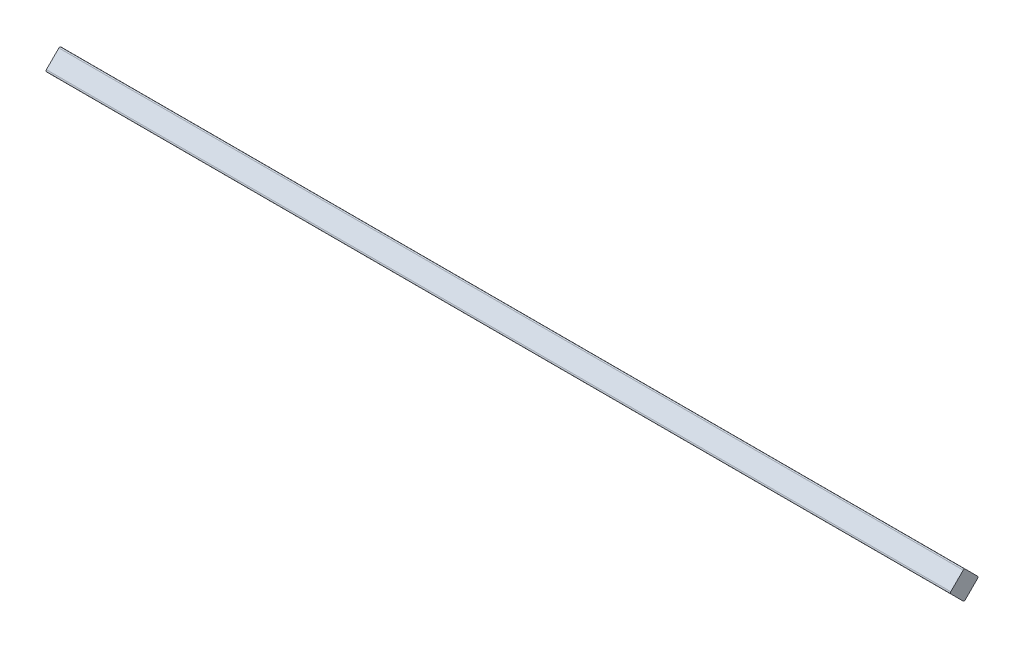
ISO-10303-21;
HEADER;
FILE_DESCRIPTION(('STEP AP214'),'2;1');
FILE_NAME('part.step','',(''),(''),'','','');
FILE_SCHEMA(('AUTOMOTIVE_DESIGN { 1 0 10303 214 1 1 1 1 }'));
ENDSEC;
DATA;
#1=APPLICATION_CONTEXT('core data for automotive mechanical design processes');
#2=APPLICATION_PROTOCOL_DEFINITION('international standard','automotive_design',2000,#1);
#3=PRODUCT_CONTEXT('',#1,'mechanical');
#4=PRODUCT('Part','Part','',(#3));
#5=PRODUCT_RELATED_PRODUCT_CATEGORY('part','',(#4));
#6=PRODUCT_DEFINITION_FORMATION('','',#4);
#7=PRODUCT_DEFINITION_CONTEXT('part definition',#1,'design');
#8=PRODUCT_DEFINITION('design','',#6,#7);
#9=PRODUCT_DEFINITION_SHAPE('','',#8);
#10=(LENGTH_UNIT() NAMED_UNIT(*) SI_UNIT(.MILLI.,.METRE.));
#11=(NAMED_UNIT(*) PLANE_ANGLE_UNIT() SI_UNIT($,.RADIAN.));
#12=(NAMED_UNIT(*) SI_UNIT($,.STERADIAN.) SOLID_ANGLE_UNIT());
#13=UNCERTAINTY_MEASURE_WITH_UNIT(LENGTH_MEASURE(1.E-05),#10,'distance_accuracy_value','');
#14=(GEOMETRIC_REPRESENTATION_CONTEXT(3) GLOBAL_UNCERTAINTY_ASSIGNED_CONTEXT((#13)) GLOBAL_UNIT_ASSIGNED_CONTEXT((#10,
#11,#12)) REPRESENTATION_CONTEXT('',''));
#15=CARTESIAN_POINT('',(0.,0.,0.));
#16=DIRECTION('',(0.,0.,1.));
#17=DIRECTION('',(1.,0.,0.));
#18=AXIS2_PLACEMENT_3D('',#15,#16,#17);
#19=CARTESIAN_POINT('',(2000.,0.,-31.8198051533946));
#20=DIRECTION('',(0.,-0.707106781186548,0.707106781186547));
#21=DIRECTION('',(0.,-0.707106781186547,-0.707106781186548));
#22=AXIS2_PLACEMENT_3D('',#19,#20,#21);
#23=PLANE('',#22);
#24=DIRECTION('',(0.,0.707106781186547,0.707106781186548));
#25=VECTOR('',#24,1.);
#26=CARTESIAN_POINT('',(2000.,0.,-31.8198051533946));
#27=LINE('',#26,#25);
#28=CARTESIAN_POINT('',(2000.,2.12132034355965,-29.698484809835));
#29=VERTEX_POINT('',#28);
#30=CARTESIAN_POINT('',(2000.,29.698484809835,-2.12132034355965));
#31=VERTEX_POINT('',#30);
#32=EDGE_CURVE('E120',#29,#31,#27,.T.);
#33=ORIENTED_EDGE('',*,*,#32,.F.);
#34=DIRECTION('',(-1.,0.,0.));
#35=VECTOR('',#34,1.);
#36=CARTESIAN_POINT('',(2000.,2.12132034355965,-29.698484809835));
#37=LINE('',#36,#35);
#38=CARTESIAN_POINT('',(0.,2.12132034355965,-29.698484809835));
#39=VERTEX_POINT('',#38);
#40=EDGE_CURVE('E11',#29,#39,#37,.T.);
#41=ORIENTED_EDGE('',*,*,#40,.T.);
#42=DIRECTION('',(0.,0.707106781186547,0.707106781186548));
#43=VECTOR('',#42,1.);
#44=CARTESIAN_POINT('',(0.,0.,-31.8198051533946));
#45=LINE('',#44,#43);
#46=CARTESIAN_POINT('',(0.,29.698484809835,-2.12132034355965));
#47=VERTEX_POINT('',#46);
#48=EDGE_CURVE('E122',#39,#47,#45,.T.);
#49=ORIENTED_EDGE('',*,*,#48,.T.);
#50=DIRECTION('',(-1.,0.,0.));
#51=VECTOR('',#50,1.);
#52=CARTESIAN_POINT('',(2000.,29.698484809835,-2.12132034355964));
#53=LINE('',#52,#51);
#54=EDGE_CURVE('E33',#47,#31,#53,.F.);
#55=ORIENTED_EDGE('',*,*,#54,.T.);
#56=EDGE_LOOP('',(#33,#41,#49,#55));
#57=FACE_BOUND('',#56,.T.);
#58=ADVANCED_FACE('F26',(#57),#23,.F.);
#59=CARTESIAN_POINT('',(2000.,31.8198051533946,0.));
#60=DIRECTION('',(0.,-0.707106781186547,-0.707106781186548));
#61=DIRECTION('',(0.,0.707106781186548,-0.707106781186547));
#62=AXIS2_PLACEMENT_3D('',#59,#60,#61);
#63=PLANE('',#62);
#64=DIRECTION('',(0.,-0.707106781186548,0.707106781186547));
#65=VECTOR('',#64,1.);
#66=CARTESIAN_POINT('',(0.,31.8198051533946,0.));
#67=LINE('',#66,#65);
#68=CARTESIAN_POINT('',(0.,29.698484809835,2.12132034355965));
#69=VERTEX_POINT('',#68);
#70=CARTESIAN_POINT('',(0.,2.12132034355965,29.698484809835));
#71=VERTEX_POINT('',#70);
#72=EDGE_CURVE('E118',#69,#71,#67,.T.);
#73=ORIENTED_EDGE('',*,*,#72,.T.);
#74=DIRECTION('',(-1.,0.,0.));
#75=VECTOR('',#74,1.);
#76=CARTESIAN_POINT('',(2000.,2.12132034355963,29.698484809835));
#77=LINE('',#76,#75);
#78=CARTESIAN_POINT('',(2000.,2.12132034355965,29.698484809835));
#79=VERTEX_POINT('',#78);
#80=EDGE_CURVE('E97',#71,#79,#77,.F.);
#81=ORIENTED_EDGE('',*,*,#80,.T.);
#82=DIRECTION('',(0.,-0.707106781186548,0.707106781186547));
#83=VECTOR('',#82,1.);
#84=CARTESIAN_POINT('',(2000.,31.8198051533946,0.));
#85=LINE('',#84,#83);
#86=CARTESIAN_POINT('',(2000.,29.698484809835,2.12132034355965));
#87=VERTEX_POINT('',#86);
#88=EDGE_CURVE('E128',#87,#79,#85,.T.);
#89=ORIENTED_EDGE('',*,*,#88,.F.);
#90=DIRECTION('',(-1.,0.,0.));
#91=VECTOR('',#90,1.);
#92=CARTESIAN_POINT('',(2000.,29.698484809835,2.12132034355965));
#93=LINE('',#92,#91);
#94=EDGE_CURVE('E102',#87,#69,#93,.T.);
#95=ORIENTED_EDGE('',*,*,#94,.T.);
#96=EDGE_LOOP('',(#73,#81,#89,#95));
#97=FACE_BOUND('',#96,.T.);
#98=ADVANCED_FACE('F166',(#97),#63,.F.);
#99=CARTESIAN_POINT('',(2000.,0.,31.8198051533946));
#100=DIRECTION('',(0.,0.707106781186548,-0.707106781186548));
#101=DIRECTION('',(0.,0.707106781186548,0.707106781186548));
#102=AXIS2_PLACEMENT_3D('',#99,#100,#101);
#103=PLANE('',#102);
#104=DIRECTION('',(0.,-0.707106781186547,-0.707106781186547));
#105=VECTOR('',#104,1.);
#106=CARTESIAN_POINT('',(2000.,0.,31.8198051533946));
#107=LINE('',#106,#105);
#108=CARTESIAN_POINT('',(2000.,-2.12132034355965,29.698484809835));
#109=VERTEX_POINT('',#108);
#110=CARTESIAN_POINT('',(2000.,-29.698484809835,2.12132034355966));
#111=VERTEX_POINT('',#110);
#112=EDGE_CURVE('E111',#109,#111,#107,.T.);
#113=ORIENTED_EDGE('',*,*,#112,.F.);
#114=DIRECTION('',(-1.,0.,0.));
#115=VECTOR('',#114,1.);
#116=CARTESIAN_POINT('',(2000.,-2.12132034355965,29.698484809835));
#117=LINE('',#116,#115);
#118=CARTESIAN_POINT('',(0.,-2.12132034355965,29.698484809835));
#119=VERTEX_POINT('',#118);
#120=EDGE_CURVE('E96',#109,#119,#117,.T.);
#121=ORIENTED_EDGE('',*,*,#120,.T.);
#122=DIRECTION('',(0.,-0.707106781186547,-0.707106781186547));
#123=VECTOR('',#122,1.);
#124=CARTESIAN_POINT('',(0.,0.,31.8198051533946));
#125=LINE('',#124,#123);
#126=CARTESIAN_POINT('',(0.,-29.698484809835,2.12132034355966));
#127=VERTEX_POINT('',#126);
#128=EDGE_CURVE('E109',#119,#127,#125,.T.);
#129=ORIENTED_EDGE('',*,*,#128,.T.);
#130=DIRECTION('',(-1.,0.,0.));
#131=VECTOR('',#130,1.);
#132=CARTESIAN_POINT('',(2000.,-29.698484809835,2.12132034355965));
#133=LINE('',#132,#131);
#134=EDGE_CURVE('E113',#127,#111,#133,.F.);
#135=ORIENTED_EDGE('',*,*,#134,.T.);
#136=EDGE_LOOP('',(#113,#121,#129,#135));
#137=FACE_BOUND('',#136,.T.);
#138=ADVANCED_FACE('F108',(#137),#103,.F.);
#139=CARTESIAN_POINT('',(2000.,-31.8198051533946,0.));
#140=DIRECTION('',(0.,0.707106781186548,0.707106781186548));
#141=DIRECTION('',(0.,-0.707106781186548,0.707106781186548));
#142=AXIS2_PLACEMENT_3D('',#139,#140,#141);
#143=PLANE('',#142);
#144=DIRECTION('',(0.,0.707106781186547,-0.707106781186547));
#145=VECTOR('',#144,1.);
#146=CARTESIAN_POINT('',(2000.,-31.8198051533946,0.));
#147=LINE('',#146,#145);
#148=CARTESIAN_POINT('',(2000.,-29.698484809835,-2.12132034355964));
#149=VERTEX_POINT('',#148);
#150=CARTESIAN_POINT('',(2000.,-2.12132034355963,-29.698484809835));
#151=VERTEX_POINT('',#150);
#152=EDGE_CURVE('E132',#149,#151,#147,.T.);
#153=ORIENTED_EDGE('',*,*,#152,.F.);
#154=DIRECTION('',(-1.,0.,0.));
#155=VECTOR('',#154,1.);
#156=CARTESIAN_POINT('',(2000.,-29.698484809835,-2.12132034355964));
#157=LINE('',#156,#155);
#158=CARTESIAN_POINT('',(0.,-29.698484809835,-2.12132034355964));
#159=VERTEX_POINT('',#158);
#160=EDGE_CURVE('E150',#149,#159,#157,.T.);
#161=ORIENTED_EDGE('',*,*,#160,.T.);
#162=DIRECTION('',(0.,0.707106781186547,-0.707106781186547));
#163=VECTOR('',#162,1.);
#164=CARTESIAN_POINT('',(0.,-31.8198051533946,0.));
#165=LINE('',#164,#163);
#166=CARTESIAN_POINT('',(0.,-2.12132034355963,-29.698484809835));
#167=VERTEX_POINT('',#166);
#168=EDGE_CURVE('E117',#159,#167,#165,.T.);
#169=ORIENTED_EDGE('',*,*,#168,.T.);
#170=DIRECTION('',(-1.,0.,0.));
#171=VECTOR('',#170,1.);
#172=CARTESIAN_POINT('',(2000.,-2.12132034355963,-29.698484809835));
#173=LINE('',#172,#171);
#174=EDGE_CURVE('E40',#167,#151,#173,.F.);
#175=ORIENTED_EDGE('',*,*,#174,.T.);
#176=EDGE_LOOP('',(#153,#161,#169,#175));
#177=FACE_BOUND('',#176,.T.);
#178=ADVANCED_FACE('F168',(#177),#143,.F.);
#179=CARTESIAN_POINT('',(2000.,31.8198051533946,0.));
#180=DIRECTION('',(1.,0.,0.));
#181=DIRECTION('',(0.,0.,-1.));
#182=AXIS2_PLACEMENT_3D('',#179,#180,#181);
#183=PLANE('',#182);
#184=ORIENTED_EDGE('',*,*,#88,.T.);
#185=CARTESIAN_POINT('',(2000.,0.,27.5771644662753));
#186=DIRECTION('',(1.,0.,0.));
#187=DIRECTION('',(0.,0.,-1.));
#188=AXIS2_PLACEMENT_3D('',#185,#186,#187);
#189=CIRCLE('',#188,3.);
#190=EDGE_CURVE('E147',#79,#109,#189,.T.);
#191=ORIENTED_EDGE('',*,*,#190,.T.);
#192=ORIENTED_EDGE('',*,*,#112,.T.);
#193=CARTESIAN_POINT('',(2000.,-27.5771644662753,0.));
#194=DIRECTION('',(1.,0.,0.));
#195=DIRECTION('',(0.,0.,-1.));
#196=AXIS2_PLACEMENT_3D('',#193,#194,#195);
#197=CIRCLE('',#196,3.);
#198=EDGE_CURVE('E47',#111,#149,#197,.T.);
#199=ORIENTED_EDGE('',*,*,#198,.T.);
#200=ORIENTED_EDGE('',*,*,#152,.T.);
#201=CARTESIAN_POINT('',(2000.,0.,-27.5771644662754));
#202=DIRECTION('',(1.,0.,0.));
#203=DIRECTION('',(0.,0.,-1.));
#204=AXIS2_PLACEMENT_3D('',#201,#202,#203);
#205=CIRCLE('',#204,3.);
#206=EDGE_CURVE('E144',#151,#29,#205,.T.);
#207=ORIENTED_EDGE('',*,*,#206,.T.);
#208=ORIENTED_EDGE('',*,*,#32,.T.);
#209=CARTESIAN_POINT('',(2000.,27.5771644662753,0.));
#210=DIRECTION('',(1.,0.,0.));
#211=DIRECTION('',(0.,0.,-1.));
#212=AXIS2_PLACEMENT_3D('',#209,#210,#211);
#213=CIRCLE('',#212,3.);
#214=EDGE_CURVE('E142',#31,#87,#213,.T.);
#215=ORIENTED_EDGE('',*,*,#214,.T.);
#216=EDGE_LOOP('',(#184,#191,#192,#199,#200,#207,#208,#215));
#217=FACE_BOUND('',#216,.T.);
#218=ADVANCED_FACE('F160',(#217),#183,.T.);
#219=CARTESIAN_POINT('',(0.,31.8198051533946,0.));
#220=DIRECTION('',(1.,0.,0.));
#221=DIRECTION('',(0.,0.,-1.));
#222=AXIS2_PLACEMENT_3D('',#219,#220,#221);
#223=PLANE('',#222);
#224=ORIENTED_EDGE('',*,*,#128,.F.);
#225=CARTESIAN_POINT('',(0.,0.,27.5771644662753));
#226=DIRECTION('',(1.,0.,0.));
#227=DIRECTION('',(0.,0.,-1.));
#228=AXIS2_PLACEMENT_3D('',#225,#226,#227);
#229=CIRCLE('',#228,3.);
#230=EDGE_CURVE('E92',#119,#71,#229,.F.);
#231=ORIENTED_EDGE('',*,*,#230,.T.);
#232=ORIENTED_EDGE('',*,*,#72,.F.);
#233=CARTESIAN_POINT('',(0.,27.5771644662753,0.));
#234=DIRECTION('',(1.,0.,0.));
#235=DIRECTION('',(0.,0.,-1.));
#236=AXIS2_PLACEMENT_3D('',#233,#234,#235);
#237=CIRCLE('',#236,3.);
#238=EDGE_CURVE('E112',#69,#47,#237,.F.);
#239=ORIENTED_EDGE('',*,*,#238,.T.);
#240=ORIENTED_EDGE('',*,*,#48,.F.);
#241=CARTESIAN_POINT('',(0.,0.,-27.5771644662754));
#242=DIRECTION('',(1.,0.,0.));
#243=DIRECTION('',(0.,0.,-1.));
#244=AXIS2_PLACEMENT_3D('',#241,#242,#243);
#245=CIRCLE('',#244,3.);
#246=EDGE_CURVE('E136',#39,#167,#245,.F.);
#247=ORIENTED_EDGE('',*,*,#246,.T.);
#248=ORIENTED_EDGE('',*,*,#168,.F.);
#249=CARTESIAN_POINT('',(0.,-27.5771644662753,0.));
#250=DIRECTION('',(1.,0.,0.));
#251=DIRECTION('',(0.,0.,-1.));
#252=AXIS2_PLACEMENT_3D('',#249,#250,#251);
#253=CIRCLE('',#252,3.);
#254=EDGE_CURVE('E103',#159,#127,#253,.F.);
#255=ORIENTED_EDGE('',*,*,#254,.T.);
#256=EDGE_LOOP('',(#224,#231,#232,#239,#240,#247,#248,#255));
#257=FACE_BOUND('',#256,.T.);
#258=ADVANCED_FACE('F115',(#257),#223,.F.);
#259=CARTESIAN_POINT('',(2000.,0.,27.5771644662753));
#260=DIRECTION('',(-1.,0.,0.));
#261=DIRECTION('',(0.,0.,1.));
#262=AXIS2_PLACEMENT_3D('',#259,#260,#261);
#263=CYLINDRICAL_SURFACE('',#262,3.);
#264=ORIENTED_EDGE('',*,*,#190,.F.);
#265=ORIENTED_EDGE('',*,*,#80,.F.);
#266=ORIENTED_EDGE('',*,*,#230,.F.);
#267=ORIENTED_EDGE('',*,*,#120,.F.);
#268=EDGE_LOOP('',(#264,#265,#266,#267));
#269=FACE_BOUND('',#268,.T.);
#270=ADVANCED_FACE('F95',(#269),#263,.T.);
#271=CARTESIAN_POINT('',(2000.,-27.5771644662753,0.));
#272=DIRECTION('',(-1.,0.,0.));
#273=DIRECTION('',(0.,0.,1.));
#274=AXIS2_PLACEMENT_3D('',#271,#272,#273);
#275=CYLINDRICAL_SURFACE('',#274,3.);
#276=ORIENTED_EDGE('',*,*,#198,.F.);
#277=ORIENTED_EDGE('',*,*,#134,.F.);
#278=ORIENTED_EDGE('',*,*,#254,.F.);
#279=ORIENTED_EDGE('',*,*,#160,.F.);
#280=EDGE_LOOP('',(#276,#277,#278,#279));
#281=FACE_BOUND('',#280,.T.);
#282=ADVANCED_FACE('F172',(#281),#275,.T.);
#283=CARTESIAN_POINT('',(2000.,0.,-27.5771644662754));
#284=DIRECTION('',(-1.,0.,0.));
#285=DIRECTION('',(0.,0.,1.));
#286=AXIS2_PLACEMENT_3D('',#283,#284,#285);
#287=CYLINDRICAL_SURFACE('',#286,3.);
#288=ORIENTED_EDGE('',*,*,#206,.F.);
#289=ORIENTED_EDGE('',*,*,#174,.F.);
#290=ORIENTED_EDGE('',*,*,#246,.F.);
#291=ORIENTED_EDGE('',*,*,#40,.F.);
#292=EDGE_LOOP('',(#288,#289,#290,#291));
#293=FACE_BOUND('',#292,.T.);
#294=ADVANCED_FACE('F170',(#293),#287,.T.);
#295=CARTESIAN_POINT('',(2000.,27.5771644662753,0.));
#296=DIRECTION('',(-1.,0.,0.));
#297=DIRECTION('',(0.,0.,1.));
#298=AXIS2_PLACEMENT_3D('',#295,#296,#297);
#299=CYLINDRICAL_SURFACE('',#298,3.);
#300=ORIENTED_EDGE('',*,*,#214,.F.);
#301=ORIENTED_EDGE('',*,*,#54,.F.);
#302=ORIENTED_EDGE('',*,*,#238,.F.);
#303=ORIENTED_EDGE('',*,*,#94,.F.);
#304=EDGE_LOOP('',(#300,#301,#302,#303));
#305=FACE_BOUND('',#304,.T.);
#306=ADVANCED_FACE('F164',(#305),#299,.T.);
#307=CLOSED_SHELL('',(#58,#98,#138,#178,#218,#258,#270,#282,#294,#306));
#308=MANIFOLD_SOLID_BREP('B2',#307);
#309=ADVANCED_BREP_SHAPE_REPRESENTATION('',(#18,#308),#14);
#310=SHAPE_DEFINITION_REPRESENTATION(#9,#309);
ENDSEC;
END-ISO-10303-21;
